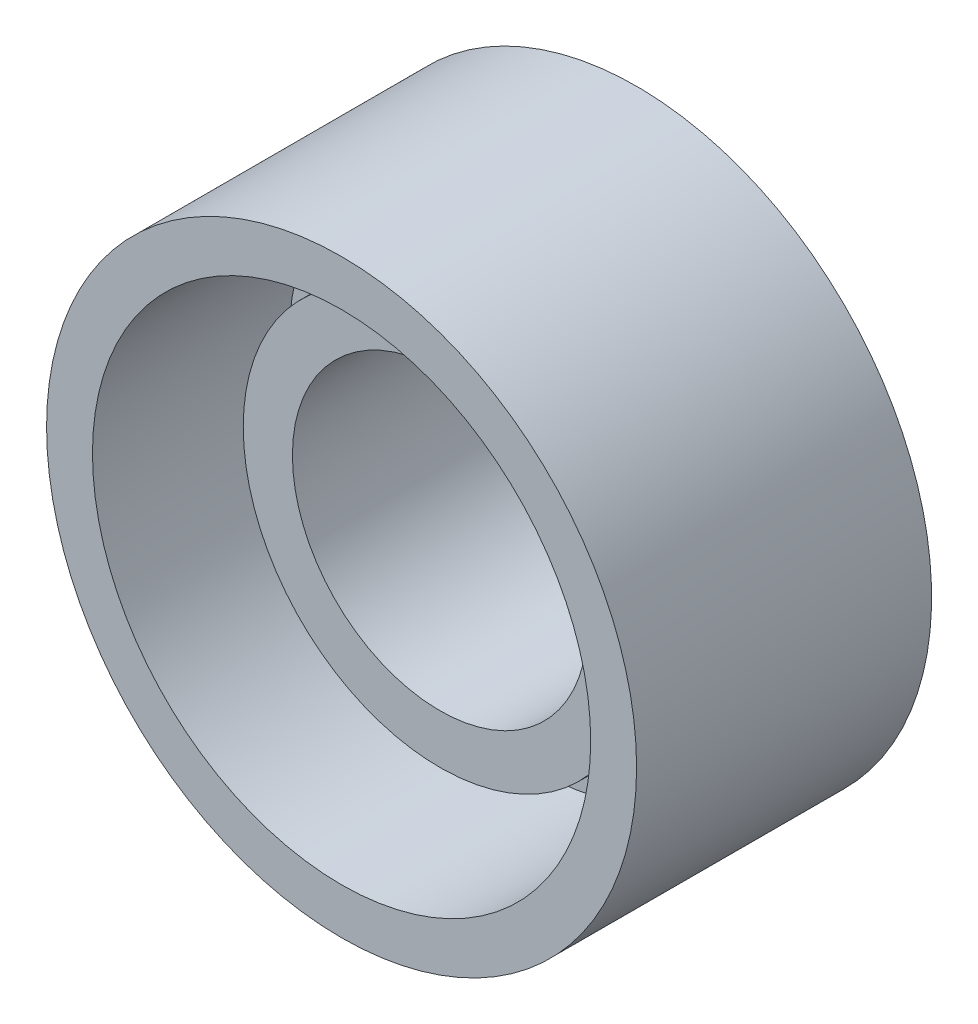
ISO-10303-21;
HEADER;
FILE_DESCRIPTION(('STEP AP214'),'2;1');
FILE_NAME('part.step','',(''),(''),'','','');
FILE_SCHEMA(('AUTOMOTIVE_DESIGN { 1 0 10303 214 1 1 1 1 }'));
ENDSEC;
DATA;
#1=APPLICATION_CONTEXT('core data for automotive mechanical design processes');
#2=APPLICATION_PROTOCOL_DEFINITION('international standard','automotive_design',2000,#1);
#3=PRODUCT_CONTEXT('',#1,'mechanical');
#4=PRODUCT('Part','Part','',(#3));
#5=PRODUCT_RELATED_PRODUCT_CATEGORY('part','',(#4));
#6=PRODUCT_DEFINITION_FORMATION('','',#4);
#7=PRODUCT_DEFINITION_CONTEXT('part definition',#1,'design');
#8=PRODUCT_DEFINITION('design','',#6,#7);
#9=PRODUCT_DEFINITION_SHAPE('','',#8);
#10=(LENGTH_UNIT() NAMED_UNIT(*) SI_UNIT(.MILLI.,.METRE.));
#11=(NAMED_UNIT(*) PLANE_ANGLE_UNIT() SI_UNIT($,.RADIAN.));
#12=(NAMED_UNIT(*) SI_UNIT($,.STERADIAN.) SOLID_ANGLE_UNIT());
#13=UNCERTAINTY_MEASURE_WITH_UNIT(LENGTH_MEASURE(1.E-05),#10,'distance_accuracy_value','');
#14=(GEOMETRIC_REPRESENTATION_CONTEXT(3) GLOBAL_UNCERTAINTY_ASSIGNED_CONTEXT((#13)) GLOBAL_UNIT_ASSIGNED_CONTEXT((#10,
#11,#12)) REPRESENTATION_CONTEXT('',''));
#15=CARTESIAN_POINT('',(0.,0.,0.));
#16=DIRECTION('',(0.,0.,1.));
#17=DIRECTION('',(1.,0.,0.));
#18=AXIS2_PLACEMENT_3D('',#15,#16,#17);
#19=CARTESIAN_POINT('',(0.,0.,30.));
#20=DIRECTION('',(0.,0.,1.));
#21=DIRECTION('',(1.,0.,0.));
#22=AXIS2_PLACEMENT_3D('',#19,#20,#21);
#23=PLANE('',#22);
#24=CARTESIAN_POINT('',(0.,0.,30.));
#25=DIRECTION('',(0.,0.,1.));
#26=DIRECTION('',(1.,0.,0.));
#27=AXIS2_PLACEMENT_3D('',#24,#25,#26);
#28=CIRCLE('',#27,45.);
#29=CARTESIAN_POINT('',(45.,0.,30.));
#30=VERTEX_POINT('',#29);
#31=EDGE_CURVE('E10',#30,#30,#28,.T.);
#32=ORIENTED_EDGE('',*,*,#31,.T.);
#33=EDGE_LOOP('',(#32));
#34=FACE_BOUND('',#33,.T.);
#35=CARTESIAN_POINT('',(0.,0.,30.));
#36=DIRECTION('',(0.,0.,1.));
#37=DIRECTION('',(1.,0.,0.));
#38=AXIS2_PLACEMENT_3D('',#35,#36,#37);
#39=CIRCLE('',#38,38.);
#40=CARTESIAN_POINT('',(38.,0.,30.));
#41=VERTEX_POINT('',#40);
#42=EDGE_CURVE('E45',#41,#41,#39,.T.);
#43=ORIENTED_EDGE('',*,*,#42,.F.);
#44=EDGE_LOOP('',(#43));
#45=FACE_BOUND('',#44,.T.);
#46=ADVANCED_FACE('F37',(#34,#45),#23,.T.);
#47=CARTESIAN_POINT('',(0.,0.,30.));
#48=DIRECTION('',(0.,0.,-1.));
#49=DIRECTION('',(-1.,0.,0.));
#50=AXIS2_PLACEMENT_3D('',#47,#48,#49);
#51=CYLINDRICAL_SURFACE('',#50,45.);
#52=ORIENTED_EDGE('',*,*,#31,.F.);
#53=EDGE_LOOP('',(#52));
#54=FACE_BOUND('',#53,.T.);
#55=CARTESIAN_POINT('',(0.,0.,-15.));
#56=DIRECTION('',(0.,0.,-1.));
#57=DIRECTION('',(-1.,0.,0.));
#58=AXIS2_PLACEMENT_3D('',#55,#56,#57);
#59=CIRCLE('',#58,45.);
#60=CARTESIAN_POINT('',(-45.,0.,-15.));
#61=VERTEX_POINT('',#60);
#62=EDGE_CURVE('E54',#61,#61,#59,.T.);
#63=ORIENTED_EDGE('',*,*,#62,.F.);
#64=EDGE_LOOP('',(#63));
#65=FACE_BOUND('',#64,.T.);
#66=ADVANCED_FACE('F39',(#54,#65),#51,.T.);
#67=CARTESIAN_POINT('',(0.,0.,30.));
#68=DIRECTION('',(0.,0.,-1.));
#69=DIRECTION('',(-1.,0.,0.));
#70=AXIS2_PLACEMENT_3D('',#67,#68,#69);
#71=CYLINDRICAL_SURFACE('',#70,38.);
#72=ORIENTED_EDGE('',*,*,#42,.T.);
#73=EDGE_LOOP('',(#72));
#74=FACE_BOUND('',#73,.T.);
#75=CARTESIAN_POINT('',(0.,0.,0.));
#76=DIRECTION('',(0.,0.,1.));
#77=DIRECTION('',(1.,0.,0.));
#78=AXIS2_PLACEMENT_3D('',#75,#76,#77);
#79=CIRCLE('',#78,38.);
#80=CARTESIAN_POINT('',(38.,0.,0.));
#81=VERTEX_POINT('',#80);
#82=EDGE_CURVE('E49',#81,#81,#79,.T.);
#83=ORIENTED_EDGE('',*,*,#82,.F.);
#84=EDGE_LOOP('',(#83));
#85=FACE_BOUND('',#84,.T.);
#86=ADVANCED_FACE('F86',(#74,#85),#71,.F.);
#87=CARTESIAN_POINT('',(0.,0.,0.));
#88=DIRECTION('',(0.,0.,-1.));
#89=DIRECTION('',(-1.,0.,0.));
#90=AXIS2_PLACEMENT_3D('',#87,#88,#89);
#91=PLANE('',#90);
#92=CARTESIAN_POINT('',(0.,0.,0.));
#93=DIRECTION('',(0.,0.,-1.));
#94=DIRECTION('',(-1.,0.,0.));
#95=AXIS2_PLACEMENT_3D('',#92,#93,#94);
#96=CIRCLE('',#95,30.);
#97=CARTESIAN_POINT('',(-30.,0.,0.));
#98=VERTEX_POINT('',#97);
#99=EDGE_CURVE('E60',#98,#98,#96,.T.);
#100=ORIENTED_EDGE('',*,*,#99,.T.);
#101=EDGE_LOOP('',(#100));
#102=FACE_BOUND('',#101,.T.);
#103=ORIENTED_EDGE('',*,*,#82,.T.);
#104=EDGE_LOOP('',(#103));
#105=FACE_BOUND('',#104,.T.);
#106=ADVANCED_FACE('F91',(#102,#105),#91,.F.);
#107=CARTESIAN_POINT('',(0.,0.,-15.));
#108=DIRECTION('',(0.,0.,-1.));
#109=DIRECTION('',(-1.,0.,0.));
#110=AXIS2_PLACEMENT_3D('',#107,#108,#109);
#111=PLANE('',#110);
#112=CARTESIAN_POINT('',(0.,0.,-15.));
#113=DIRECTION('',(0.,0.,-1.));
#114=DIRECTION('',(-1.,0.,0.));
#115=AXIS2_PLACEMENT_3D('',#112,#113,#114);
#116=CIRCLE('',#115,22.5);
#117=CARTESIAN_POINT('',(-22.5,0.,-15.));
#118=VERTEX_POINT('',#117);
#119=EDGE_CURVE('E63',#118,#118,#116,.T.);
#120=ORIENTED_EDGE('',*,*,#119,.F.);
#121=EDGE_LOOP('',(#120));
#122=FACE_BOUND('',#121,.T.);
#123=ORIENTED_EDGE('',*,*,#62,.T.);
#124=EDGE_LOOP('',(#123));
#125=FACE_BOUND('',#124,.T.);
#126=ADVANCED_FACE('F93',(#122,#125),#111,.T.);
#127=CARTESIAN_POINT('',(0.,0.,15.));
#128=DIRECTION('',(0.,0.,-1.));
#129=DIRECTION('',(-1.,0.,0.));
#130=AXIS2_PLACEMENT_3D('',#127,#128,#129);
#131=CYLINDRICAL_SURFACE('',#130,30.);
#132=CARTESIAN_POINT('',(0.,0.,15.));
#133=DIRECTION('',(0.,0.,-1.));
#134=DIRECTION('',(-1.,0.,0.));
#135=AXIS2_PLACEMENT_3D('',#132,#133,#134);
#136=CIRCLE('',#135,30.);
#137=CARTESIAN_POINT('',(-30.,0.,15.));
#138=VERTEX_POINT('',#137);
#139=EDGE_CURVE('E57',#138,#138,#136,.T.);
#140=ORIENTED_EDGE('',*,*,#139,.T.);
#141=EDGE_LOOP('',(#140));
#142=FACE_BOUND('',#141,.T.);
#143=ORIENTED_EDGE('',*,*,#99,.F.);
#144=EDGE_LOOP('',(#143));
#145=FACE_BOUND('',#144,.T.);
#146=ADVANCED_FACE('F79',(#142,#145),#131,.T.);
#147=CARTESIAN_POINT('',(0.,0.,15.));
#148=DIRECTION('',(0.,0.,-1.));
#149=DIRECTION('',(-1.,0.,0.));
#150=AXIS2_PLACEMENT_3D('',#147,#148,#149);
#151=PLANE('',#150);
#152=CARTESIAN_POINT('',(0.,0.,15.));
#153=DIRECTION('',(0.,0.,-1.));
#154=DIRECTION('',(-1.,0.,0.));
#155=AXIS2_PLACEMENT_3D('',#152,#153,#154);
#156=CIRCLE('',#155,22.5);
#157=CARTESIAN_POINT('',(-22.5,0.,15.));
#158=VERTEX_POINT('',#157);
#159=EDGE_CURVE('E41',#158,#158,#156,.T.);
#160=ORIENTED_EDGE('',*,*,#159,.T.);
#161=EDGE_LOOP('',(#160));
#162=FACE_BOUND('',#161,.T.);
#163=ORIENTED_EDGE('',*,*,#139,.F.);
#164=EDGE_LOOP('',(#163));
#165=FACE_BOUND('',#164,.T.);
#166=ADVANCED_FACE('F70',(#162,#165),#151,.F.);
#167=CARTESIAN_POINT('',(0.,0.,30.));
#168=DIRECTION('',(0.,0.,-1.));
#169=DIRECTION('',(-1.,0.,0.));
#170=AXIS2_PLACEMENT_3D('',#167,#168,#169);
#171=CYLINDRICAL_SURFACE('',#170,22.5);
#172=CARTESIAN_POINT('',(-22.5,0.,-15.));
#173=CARTESIAN_POINT('',(-22.5,0.,-14.6875));
#174=CARTESIAN_POINT('',(-22.5,0.,-14.375));
#175=CARTESIAN_POINT('',(-22.5,0.,-13.75));
#176=CARTESIAN_POINT('',(-22.5,0.,-13.4375));
#177=CARTESIAN_POINT('',(-22.5,0.,-12.8125));
#178=CARTESIAN_POINT('',(-22.5,0.,-12.5));
#179=CARTESIAN_POINT('',(-22.5,0.,-11.875));
#180=CARTESIAN_POINT('',(-22.5,0.,-11.5625));
#181=CARTESIAN_POINT('',(-22.5,0.,-10.9375));
#182=CARTESIAN_POINT('',(-22.5,0.,-10.625));
#183=CARTESIAN_POINT('',(-22.5,0.,-9.99999999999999));
#184=CARTESIAN_POINT('',(-22.5,0.,-9.68749999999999));
#185=CARTESIAN_POINT('',(-22.5,0.,-9.06249999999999));
#186=CARTESIAN_POINT('',(-22.5,0.,-8.74999999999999));
#187=CARTESIAN_POINT('',(-22.5,0.,-8.12499999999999));
#188=CARTESIAN_POINT('',(-22.5,0.,-7.81249999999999));
#189=CARTESIAN_POINT('',(-22.5,0.,-7.18749999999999));
#190=CARTESIAN_POINT('',(-22.5,0.,-6.87499999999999));
#191=CARTESIAN_POINT('',(-22.5,0.,-6.24999999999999));
#192=CARTESIAN_POINT('',(-22.5,0.,-5.93749999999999));
#193=CARTESIAN_POINT('',(-22.5,0.,-5.31249999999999));
#194=CARTESIAN_POINT('',(-22.5,0.,-4.99999999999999));
#195=CARTESIAN_POINT('',(-22.5,0.,-4.37499999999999));
#196=CARTESIAN_POINT('',(-22.5,0.,-4.06249999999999));
#197=CARTESIAN_POINT('',(-22.5,0.,-3.43749999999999));
#198=CARTESIAN_POINT('',(-22.5,0.,-3.12499999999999));
#199=CARTESIAN_POINT('',(-22.5,0.,-2.49999999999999));
#200=CARTESIAN_POINT('',(-22.5,0.,-2.18749999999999));
#201=CARTESIAN_POINT('',(-22.5,0.,-1.5625));
#202=CARTESIAN_POINT('',(-22.5,0.,-1.25));
#203=CARTESIAN_POINT('',(-22.5,0.,-0.624999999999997));
#204=CARTESIAN_POINT('',(-22.5,0.,-0.312499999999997));
#205=CARTESIAN_POINT('',(-22.5,0.,0.312500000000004));
#206=CARTESIAN_POINT('',(-22.5,0.,0.625000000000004));
#207=CARTESIAN_POINT('',(-22.5,0.,1.25));
#208=CARTESIAN_POINT('',(-22.5,0.,1.5625));
#209=CARTESIAN_POINT('',(-22.5,0.,2.1875));
#210=CARTESIAN_POINT('',(-22.5,0.,2.5));
#211=CARTESIAN_POINT('',(-22.5,0.,3.125));
#212=CARTESIAN_POINT('',(-22.5,0.,3.4375));
#213=CARTESIAN_POINT('',(-22.5,0.,4.0625));
#214=CARTESIAN_POINT('',(-22.5,0.,4.375));
#215=CARTESIAN_POINT('',(-22.5,0.,5.));
#216=CARTESIAN_POINT('',(-22.5,0.,5.3125));
#217=CARTESIAN_POINT('',(-22.5,0.,5.9375));
#218=CARTESIAN_POINT('',(-22.5,0.,6.25));
#219=CARTESIAN_POINT('',(-22.5,0.,6.875));
#220=CARTESIAN_POINT('',(-22.5,0.,7.1875));
#221=CARTESIAN_POINT('',(-22.5,0.,7.8125));
#222=CARTESIAN_POINT('',(-22.5,0.,8.125));
#223=CARTESIAN_POINT('',(-22.5,0.,8.75));
#224=CARTESIAN_POINT('',(-22.5,0.,9.06250000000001));
#225=CARTESIAN_POINT('',(-22.5,0.,9.6875));
#226=CARTESIAN_POINT('',(-22.5,0.,10.));
#227=CARTESIAN_POINT('',(-22.5,0.,10.625));
#228=CARTESIAN_POINT('',(-22.5,0.,10.9375));
#229=CARTESIAN_POINT('',(-22.5,0.,11.5625));
#230=CARTESIAN_POINT('',(-22.5,0.,11.875));
#231=CARTESIAN_POINT('',(-22.5,0.,12.5));
#232=CARTESIAN_POINT('',(-22.5,0.,12.8125));
#233=CARTESIAN_POINT('',(-22.5,0.,13.4375));
#234=CARTESIAN_POINT('',(-22.5,0.,13.75));
#235=CARTESIAN_POINT('',(-22.5,0.,14.375));
#236=CARTESIAN_POINT('',(-22.5,0.,14.6875));
#237=CARTESIAN_POINT('',(-22.5,0.,15.));
#238=B_SPLINE_CURVE_WITH_KNOTS('',3,(#172,#173,#174,#175,#176,#177,#178,#179,#180,#181,#182,
#183,#184,#185,#186,#187,#188,#189,#190,#191,#192,#193,#194,#195,#196,#197,#198,#199,#200,#201,
#202,#203,#204,#205,#206,#207,#208,#209,#210,#211,#212,#213,#214,#215,#216,#217,#218,#219,#220,
#221,#222,#223,#224,#225,#226,#227,#228,#229,#230,#231,#232,#233,#234,#235,#236,#237),
.UNSPECIFIED.,.F.,.F.,(4,2,2,2,2,2,2,2,2,2,2,2,2,2,2,2,2,2,2,2,2,2,2,2,2,2,2,2,2,2,2,2,4),(0.,
0.937500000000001,1.875,2.8125,3.75,4.6875,5.625,6.5625,7.5,8.4375,9.375,10.3125,11.25,12.1875,
13.125,14.0625,15.,15.9375,16.875,17.8125,18.75,19.6875,20.625,21.5625,22.5,23.4375,24.375,
25.3125,26.25,27.1875,28.125,29.0625,30.),.UNSPECIFIED.);
#239=EDGE_CURVE('BSEAM73',#118,#158,#238,.T.);
#240=ORIENTED_EDGE('',*,*,#119,.T.);
#241=ORIENTED_EDGE('',*,*,#159,.F.);
#242=ORIENTED_EDGE('',*,*,#239,.T.);
#243=ORIENTED_EDGE('',*,*,#239,.F.);
#244=EDGE_LOOP('',(#240,#242,#241,#243));
#245=FACE_BOUND('',#244,.T.);
#246=ADVANCED_FACE('F73',(#245),#171,.F.);
#247=CLOSED_SHELL('',(#46,#66,#86,#106,#126,#146,#166,#246));
#248=MANIFOLD_SOLID_BREP('B2',#247);
#249=ADVANCED_BREP_SHAPE_REPRESENTATION('',(#18,#248),#14);
#250=SHAPE_DEFINITION_REPRESENTATION(#9,#249);
ENDSEC;
END-ISO-10303-21;
